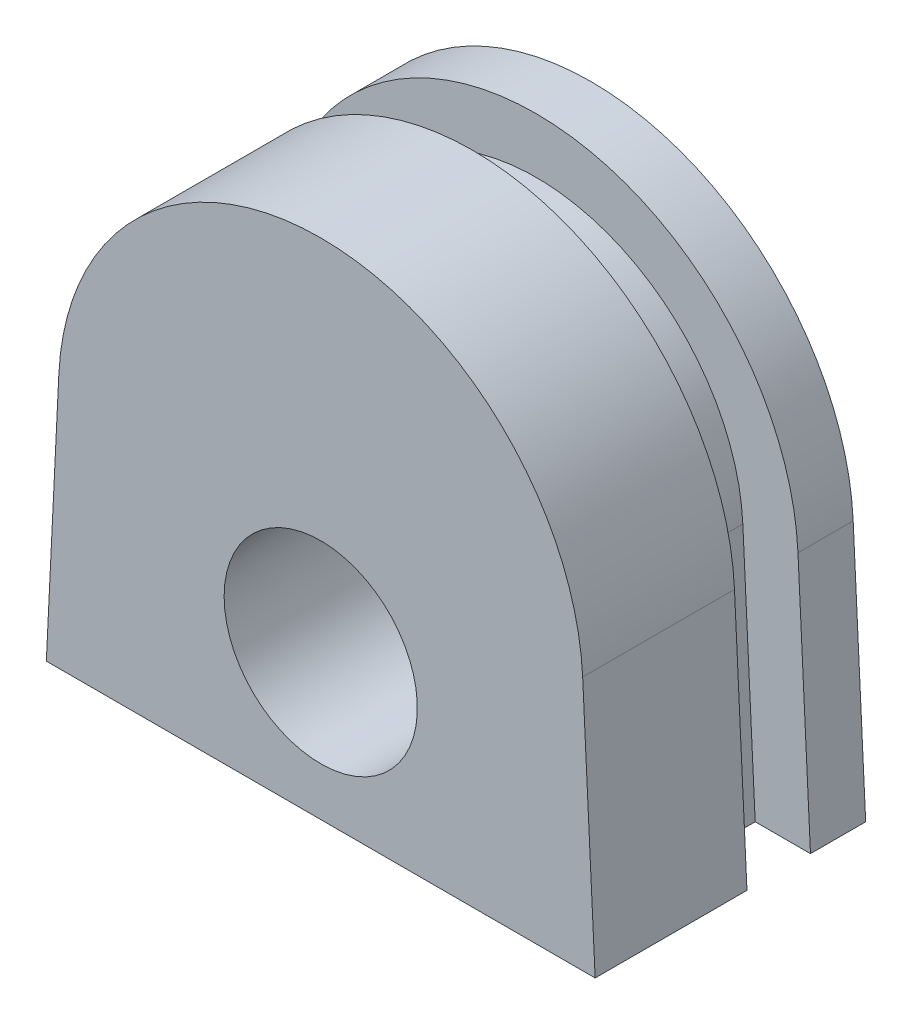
ISO-10303-21;
HEADER;
FILE_DESCRIPTION(('STEP AP214'),'2;1');
FILE_NAME('part.step','',(''),(''),'','','');
FILE_SCHEMA(('AUTOMOTIVE_DESIGN { 1 0 10303 214 1 1 1 1 }'));
ENDSEC;
DATA;
#1=APPLICATION_CONTEXT('core data for automotive mechanical design processes');
#2=APPLICATION_PROTOCOL_DEFINITION('international standard','automotive_design',2000,#1);
#3=PRODUCT_CONTEXT('',#1,'mechanical');
#4=PRODUCT('Part','Part','',(#3));
#5=PRODUCT_RELATED_PRODUCT_CATEGORY('part','',(#4));
#6=PRODUCT_DEFINITION_FORMATION('','',#4);
#7=PRODUCT_DEFINITION_CONTEXT('part definition',#1,'design');
#8=PRODUCT_DEFINITION('design','',#6,#7);
#9=PRODUCT_DEFINITION_SHAPE('','',#8);
#10=(LENGTH_UNIT() NAMED_UNIT(*) SI_UNIT(.MILLI.,.METRE.));
#11=(NAMED_UNIT(*) PLANE_ANGLE_UNIT() SI_UNIT($,.RADIAN.));
#12=(NAMED_UNIT(*) SI_UNIT($,.STERADIAN.) SOLID_ANGLE_UNIT());
#13=UNCERTAINTY_MEASURE_WITH_UNIT(LENGTH_MEASURE(1.E-05),#10,'distance_accuracy_value','');
#14=(GEOMETRIC_REPRESENTATION_CONTEXT(3) GLOBAL_UNCERTAINTY_ASSIGNED_CONTEXT((#13)) GLOBAL_UNIT_ASSIGNED_CONTEXT((#10,
#11,#12)) REPRESENTATION_CONTEXT('',''));
#15=CARTESIAN_POINT('',(0.,0.,0.));
#16=DIRECTION('',(0.,0.,1.));
#17=DIRECTION('',(1.,0.,0.));
#18=AXIS2_PLACEMENT_3D('',#15,#16,#17);
#19=CARTESIAN_POINT('',(-14.25,5.57311545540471,-2.3));
#20=DIRECTION('',(0.,0.,1.));
#21=DIRECTION('',(1.,0.,0.));
#22=AXIS2_PLACEMENT_3D('',#19,#20,#21);
#23=CYLINDRICAL_SURFACE('',#22,7.49999999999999);
#24=CARTESIAN_POINT('',(-14.25,5.57311545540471,0.));
#25=DIRECTION('',(0.,0.,1.));
#26=DIRECTION('',(1.,0.,0.));
#27=AXIS2_PLACEMENT_3D('',#24,#25,#26);
#28=CIRCLE('',#27,7.49999999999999);
#29=CARTESIAN_POINT('',(-6.7590229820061,5.94089706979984,0.));
#30=VERTEX_POINT('',#29);
#31=CARTESIAN_POINT('',(-21.7409770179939,5.94089706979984,0.));
#32=VERTEX_POINT('',#31);
#33=EDGE_CURVE('E212',#30,#32,#28,.T.);
#34=ORIENTED_EDGE('',*,*,#33,.F.);
#35=DIRECTION('',(0.,0.,1.));
#36=VECTOR('',#35,1.);
#37=CARTESIAN_POINT('',(-6.7590229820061,5.94089706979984,-2.3));
#38=LINE('',#37,#36);
#39=CARTESIAN_POINT('',(-6.7590229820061,5.94089706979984,-2.3));
#40=VERTEX_POINT('',#39);
#41=EDGE_CURVE('E11',#40,#30,#38,.T.);
#42=ORIENTED_EDGE('',*,*,#41,.F.);
#43=CARTESIAN_POINT('',(-14.25,5.57311545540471,-2.3));
#44=DIRECTION('',(0.,0.,1.));
#45=DIRECTION('',(1.,0.,0.));
#46=AXIS2_PLACEMENT_3D('',#43,#44,#45);
#47=CIRCLE('',#46,7.49999999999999);
#48=CARTESIAN_POINT('',(-21.7409770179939,5.94089706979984,-2.3));
#49=VERTEX_POINT('',#48);
#50=EDGE_CURVE('E189',#40,#49,#47,.T.);
#51=ORIENTED_EDGE('',*,*,#50,.T.);
#52=DIRECTION('',(0.,0.,1.));
#53=VECTOR('',#52,1.);
#54=CARTESIAN_POINT('',(-21.7409770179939,5.94089706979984,-2.3));
#55=LINE('',#54,#53);
#56=EDGE_CURVE('E182',#49,#32,#55,.T.);
#57=ORIENTED_EDGE('',*,*,#56,.T.);
#58=EDGE_LOOP('',(#34,#42,#51,#57));
#59=FACE_BOUND('',#58,.T.);
#60=ADVANCED_FACE('F29',(#59),#23,.T.);
#61=CARTESIAN_POINT('',(-6.31137076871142,-3.17688454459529,-2.3));
#62=DIRECTION('',(0.998796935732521,0.049037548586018,0.));
#63=DIRECTION('',(-0.049037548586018,0.998796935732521,0.));
#64=AXIS2_PLACEMENT_3D('',#61,#62,#63);
#65=PLANE('',#64);
#66=DIRECTION('',(-0.049037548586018,0.998796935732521,0.));
#67=VECTOR('',#66,1.);
#68=CARTESIAN_POINT('',(-6.31137076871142,-3.17688454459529,0.));
#69=LINE('',#68,#67);
#70=CARTESIAN_POINT('',(-6.31137076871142,-3.17688454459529,0.));
#71=VERTEX_POINT('',#70);
#72=EDGE_CURVE('E192',#71,#30,#69,.T.);
#73=ORIENTED_EDGE('',*,*,#72,.F.);
#74=DIRECTION('',(0.,0.,1.));
#75=VECTOR('',#74,1.);
#76=CARTESIAN_POINT('',(-6.31137076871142,-3.17688454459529,-2.3));
#77=LINE('',#76,#75);
#78=CARTESIAN_POINT('',(-6.31137076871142,-3.17688454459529,-2.3));
#79=VERTEX_POINT('',#78);
#80=EDGE_CURVE('E37',#79,#71,#77,.T.);
#81=ORIENTED_EDGE('',*,*,#80,.F.);
#82=DIRECTION('',(-0.049037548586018,0.998796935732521,0.));
#83=VECTOR('',#82,1.);
#84=CARTESIAN_POINT('',(-6.31137076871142,-3.17688454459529,-2.3));
#85=LINE('',#84,#83);
#86=EDGE_CURVE('E188',#79,#40,#85,.T.);
#87=ORIENTED_EDGE('',*,*,#86,.T.);
#88=ORIENTED_EDGE('',*,*,#41,.T.);
#89=EDGE_LOOP('',(#73,#81,#87,#88));
#90=FACE_BOUND('',#89,.T.);
#91=ADVANCED_FACE('F276',(#90),#65,.T.);
#92=CARTESIAN_POINT('',(-6.31137076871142,-3.17688454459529,-2.3));
#93=DIRECTION('',(0.,-1.,0.));
#94=DIRECTION('',(1.,0.,0.));
#95=AXIS2_PLACEMENT_3D('',#92,#93,#94);
#96=PLANE('',#95);
#97=ORIENTED_EDGE('',*,*,#80,.T.);
#98=DIRECTION('',(1.,0.,0.));
#99=VECTOR('',#98,1.);
#100=CARTESIAN_POINT('',(-4.30896174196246,-3.17688454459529,0.));
#101=LINE('',#100,#99);
#102=CARTESIAN_POINT('',(-4.30896174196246,-3.17688454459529,0.));
#103=VERTEX_POINT('',#102);
#104=EDGE_CURVE('E218',#71,#103,#101,.T.);
#105=ORIENTED_EDGE('',*,*,#104,.T.);
#106=DIRECTION('',(0.,0.,-1.));
#107=VECTOR('',#106,1.);
#108=CARTESIAN_POINT('',(-4.30896174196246,-3.17688454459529,5.5));
#109=LINE('',#108,#107);
#110=CARTESIAN_POINT('',(-4.30896174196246,-3.17688454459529,5.5));
#111=VERTEX_POINT('',#110);
#112=EDGE_CURVE('E215',#111,#103,#109,.T.);
#113=ORIENTED_EDGE('',*,*,#112,.F.);
#114=DIRECTION('',(1.,0.,0.));
#115=VECTOR('',#114,1.);
#116=CARTESIAN_POINT('',(-4.30896174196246,-3.17688454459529,5.5));
#117=LINE('',#116,#115);
#118=CARTESIAN_POINT('',(-24.1910382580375,-3.17688454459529,5.5));
#119=VERTEX_POINT('',#118);
#120=EDGE_CURVE('E232',#119,#111,#117,.T.);
#121=ORIENTED_EDGE('',*,*,#120,.F.);
#122=DIRECTION('',(0.,0.,-1.));
#123=VECTOR('',#122,1.);
#124=CARTESIAN_POINT('',(-24.1910382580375,-3.17688454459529,5.5));
#125=LINE('',#124,#123);
#126=CARTESIAN_POINT('',(-24.1910382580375,-3.17688454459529,0.));
#127=VERTEX_POINT('',#126);
#128=EDGE_CURVE('E213',#119,#127,#125,.T.);
#129=ORIENTED_EDGE('',*,*,#128,.T.);
#130=CARTESIAN_POINT('',(-22.1886292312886,-3.17688454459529,0.));
#131=VERTEX_POINT('',#130);
#132=EDGE_CURVE('E178',#127,#131,#101,.T.);
#133=ORIENTED_EDGE('',*,*,#132,.T.);
#134=DIRECTION('',(0.,0.,1.));
#135=VECTOR('',#134,1.);
#136=CARTESIAN_POINT('',(-22.1886292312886,-3.17688454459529,-2.3));
#137=LINE('',#136,#135);
#138=CARTESIAN_POINT('',(-22.1886292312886,-3.17688454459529,-2.3));
#139=VERTEX_POINT('',#138);
#140=EDGE_CURVE('E175',#139,#131,#137,.T.);
#141=ORIENTED_EDGE('',*,*,#140,.F.);
#142=DIRECTION('',(-1.,0.,0.));
#143=VECTOR('',#142,1.);
#144=CARTESIAN_POINT('',(-4.30896174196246,-3.17688454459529,-2.3));
#145=LINE('',#144,#143);
#146=CARTESIAN_POINT('',(-24.1910382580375,-3.17688454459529,-2.3));
#147=VERTEX_POINT('',#146);
#148=EDGE_CURVE('E45',#139,#147,#145,.T.);
#149=ORIENTED_EDGE('',*,*,#148,.T.);
#150=DIRECTION('',(0.,0.,1.));
#151=VECTOR('',#150,1.);
#152=CARTESIAN_POINT('',(-24.1910382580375,-3.17688454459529,-4.3));
#153=LINE('',#152,#151);
#154=CARTESIAN_POINT('',(-24.1910382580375,-3.17688454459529,-4.3));
#155=VERTEX_POINT('',#154);
#156=EDGE_CURVE('E141',#155,#147,#153,.T.);
#157=ORIENTED_EDGE('',*,*,#156,.F.);
#158=DIRECTION('',(-1.,0.,0.));
#159=VECTOR('',#158,1.);
#160=CARTESIAN_POINT('',(-4.30896174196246,-3.17688454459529,-4.3));
#161=LINE('',#160,#159);
#162=CARTESIAN_POINT('',(-4.30896174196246,-3.17688454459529,-4.3));
#163=VERTEX_POINT('',#162);
#164=EDGE_CURVE('E165',#163,#155,#161,.T.);
#165=ORIENTED_EDGE('',*,*,#164,.F.);
#166=DIRECTION('',(0.,0.,1.));
#167=VECTOR('',#166,1.);
#168=CARTESIAN_POINT('',(-4.30896174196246,-3.17688454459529,-4.3));
#169=LINE('',#168,#167);
#170=CARTESIAN_POINT('',(-4.30896174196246,-3.17688454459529,-2.3));
#171=VERTEX_POINT('',#170);
#172=EDGE_CURVE('E161',#163,#171,#169,.T.);
#173=ORIENTED_EDGE('',*,*,#172,.T.);
#174=EDGE_CURVE('E158',#171,#79,#145,.T.);
#175=ORIENTED_EDGE('',*,*,#174,.T.);
#176=EDGE_LOOP('',(#97,#105,#113,#121,#129,#133,#141,#149,#157,#165,#173,#175));
#177=FACE_BOUND('',#176,.T.);
#178=ADVANCED_FACE('F173',(#177),#96,.T.);
#179=CARTESIAN_POINT('',(-21.7409770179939,5.94089706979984,-2.3));
#180=DIRECTION('',(-0.998796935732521,0.049037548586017,0.));
#181=DIRECTION('',(-0.049037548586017,-0.998796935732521,0.));
#182=AXIS2_PLACEMENT_3D('',#179,#180,#181);
#183=PLANE('',#182);
#184=DIRECTION('',(-0.049037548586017,-0.998796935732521,0.));
#185=VECTOR('',#184,1.);
#186=CARTESIAN_POINT('',(-21.7409770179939,5.94089706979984,0.));
#187=LINE('',#186,#185);
#188=EDGE_CURVE('E196',#32,#131,#187,.T.);
#189=ORIENTED_EDGE('',*,*,#188,.F.);
#190=ORIENTED_EDGE('',*,*,#56,.F.);
#191=DIRECTION('',(-0.049037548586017,-0.998796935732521,0.));
#192=VECTOR('',#191,1.);
#193=CARTESIAN_POINT('',(-21.7409770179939,5.94089706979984,-2.3));
#194=LINE('',#193,#192);
#195=EDGE_CURVE('E185',#49,#139,#194,.T.);
#196=ORIENTED_EDGE('',*,*,#195,.T.);
#197=ORIENTED_EDGE('',*,*,#140,.T.);
#198=EDGE_LOOP('',(#189,#190,#196,#197));
#199=FACE_BOUND('',#198,.T.);
#200=ADVANCED_FACE('F186',(#199),#183,.T.);
#201=CARTESIAN_POINT('',(-14.25,5.57311545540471,0.));
#202=DIRECTION('',(0.,0.,1.));
#203=DIRECTION('',(1.,0.,0.));
#204=AXIS2_PLACEMENT_3D('',#201,#202,#203);
#205=PLANE('',#204);
#206=ORIENTED_EDGE('',*,*,#33,.T.);
#207=ORIENTED_EDGE('',*,*,#188,.T.);
#208=ORIENTED_EDGE('',*,*,#132,.F.);
#209=DIRECTION('',(-0.049037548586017,-0.998796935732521,0.));
#210=VECTOR('',#209,1.);
#211=CARTESIAN_POINT('',(-23.7385708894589,6.03897216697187,0.));
#212=LINE('',#211,#210);
#213=CARTESIAN_POINT('',(-23.7385708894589,6.03897216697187,0.));
#214=VERTEX_POINT('',#213);
#215=EDGE_CURVE('E135',#214,#127,#212,.T.);
#216=ORIENTED_EDGE('',*,*,#215,.F.);
#217=CARTESIAN_POINT('',(-14.25,5.57311545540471,0.));
#218=DIRECTION('',(0.,0.,1.));
#219=DIRECTION('',(1.,0.,0.));
#220=AXIS2_PLACEMENT_3D('',#217,#218,#219);
#221=CIRCLE('',#220,9.49999999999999);
#222=CARTESIAN_POINT('',(-4.76142911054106,6.03897216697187,0.));
#223=VERTEX_POINT('',#222);
#224=EDGE_CURVE('E227',#223,#214,#221,.T.);
#225=ORIENTED_EDGE('',*,*,#224,.F.);
#226=DIRECTION('',(-0.0490375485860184,0.998796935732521,0.));
#227=VECTOR('',#226,1.);
#228=CARTESIAN_POINT('',(-4.30896174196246,-3.17688454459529,0.));
#229=LINE('',#228,#227);
#230=EDGE_CURVE('E224',#103,#223,#229,.T.);
#231=ORIENTED_EDGE('',*,*,#230,.F.);
#232=ORIENTED_EDGE('',*,*,#104,.F.);
#233=ORIENTED_EDGE('',*,*,#72,.T.);
#234=EDGE_LOOP('',(#206,#207,#208,#216,#225,#231,#232,#233));
#235=FACE_BOUND('',#234,.T.);
#236=ADVANCED_FACE('F252',(#235),#205,.F.);
#237=CARTESIAN_POINT('',(-23.7385708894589,6.03897216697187,5.5));
#238=DIRECTION('',(0.998796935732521,-0.049037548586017,0.));
#239=DIRECTION('',(0.049037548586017,0.998796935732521,0.));
#240=AXIS2_PLACEMENT_3D('',#237,#238,#239);
#241=PLANE('',#240);
#242=ORIENTED_EDGE('',*,*,#215,.T.);
#243=ORIENTED_EDGE('',*,*,#128,.F.);
#244=DIRECTION('',(-0.049037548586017,-0.998796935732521,0.));
#245=VECTOR('',#244,1.);
#246=CARTESIAN_POINT('',(-23.7385708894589,6.03897216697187,5.5));
#247=LINE('',#246,#245);
#248=CARTESIAN_POINT('',(-23.7385708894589,6.03897216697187,5.5));
#249=VERTEX_POINT('',#248);
#250=EDGE_CURVE('E229',#249,#119,#247,.T.);
#251=ORIENTED_EDGE('',*,*,#250,.F.);
#252=DIRECTION('',(0.,0.,-1.));
#253=VECTOR('',#252,1.);
#254=CARTESIAN_POINT('',(-23.7385708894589,6.03897216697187,5.5));
#255=LINE('',#254,#253);
#256=EDGE_CURVE('E238',#249,#214,#255,.T.);
#257=ORIENTED_EDGE('',*,*,#256,.T.);
#258=EDGE_LOOP('',(#242,#243,#251,#257));
#259=FACE_BOUND('',#258,.T.);
#260=ADVANCED_FACE('F261',(#259),#241,.F.);
#261=CARTESIAN_POINT('',(-4.30896174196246,-3.17688454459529,5.5));
#262=DIRECTION('',(-0.998796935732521,-0.0490375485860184,0.));
#263=DIRECTION('',(0.0490375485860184,-0.998796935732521,0.));
#264=AXIS2_PLACEMENT_3D('',#261,#262,#263);
#265=PLANE('',#264);
#266=ORIENTED_EDGE('',*,*,#230,.T.);
#267=DIRECTION('',(0.,0.,-1.));
#268=VECTOR('',#267,1.);
#269=CARTESIAN_POINT('',(-4.76142911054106,6.03897216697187,5.5));
#270=LINE('',#269,#268);
#271=CARTESIAN_POINT('',(-4.76142911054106,6.03897216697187,5.5));
#272=VERTEX_POINT('',#271);
#273=EDGE_CURVE('E241',#272,#223,#270,.T.);
#274=ORIENTED_EDGE('',*,*,#273,.F.);
#275=DIRECTION('',(-0.0490375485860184,0.998796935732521,0.));
#276=VECTOR('',#275,1.);
#277=CARTESIAN_POINT('',(-4.30896174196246,-3.17688454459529,5.5));
#278=LINE('',#277,#276);
#279=EDGE_CURVE('E234',#111,#272,#278,.T.);
#280=ORIENTED_EDGE('',*,*,#279,.F.);
#281=ORIENTED_EDGE('',*,*,#112,.T.);
#282=EDGE_LOOP('',(#266,#274,#280,#281));
#283=FACE_BOUND('',#282,.T.);
#284=ADVANCED_FACE('F249',(#283),#265,.F.);
#285=CARTESIAN_POINT('',(-14.25,5.57311545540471,5.5));
#286=DIRECTION('',(0.,0.,-1.));
#287=DIRECTION('',(-1.,0.,0.));
#288=AXIS2_PLACEMENT_3D('',#285,#286,#287);
#289=CYLINDRICAL_SURFACE('',#288,9.49999999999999);
#290=ORIENTED_EDGE('',*,*,#224,.T.);
#291=ORIENTED_EDGE('',*,*,#256,.F.);
#292=CARTESIAN_POINT('',(-14.25,5.57311545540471,5.5));
#293=DIRECTION('',(0.,0.,1.));
#294=DIRECTION('',(1.,0.,0.));
#295=AXIS2_PLACEMENT_3D('',#292,#293,#294);
#296=CIRCLE('',#295,9.49999999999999);
#297=EDGE_CURVE('E236',#272,#249,#296,.T.);
#298=ORIENTED_EDGE('',*,*,#297,.F.);
#299=ORIENTED_EDGE('',*,*,#273,.T.);
#300=EDGE_LOOP('',(#290,#291,#298,#299));
#301=FACE_BOUND('',#300,.T.);
#302=ADVANCED_FACE('F257',(#301),#289,.T.);
#303=CARTESIAN_POINT('',(-14.25,5.57311545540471,5.5));
#304=DIRECTION('',(0.,0.,1.));
#305=DIRECTION('',(1.,0.,0.));
#306=AXIS2_PLACEMENT_3D('',#303,#304,#305);
#307=PLANE('',#306);
#308=CARTESIAN_POINT('',(-14.25,2.07311545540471,5.5));
#309=DIRECTION('',(0.,0.,-1.));
#310=DIRECTION('',(-1.,0.,0.));
#311=AXIS2_PLACEMENT_3D('',#308,#309,#310);
#312=CIRCLE('',#311,3.5);
#313=CARTESIAN_POINT('',(-17.75,2.07311545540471,5.5));
#314=VERTEX_POINT('',#313);
#315=EDGE_CURVE('E142',#314,#314,#312,.T.);
#316=ORIENTED_EDGE('',*,*,#315,.T.);
#317=EDGE_LOOP('',(#316));
#318=FACE_BOUND('',#317,.T.);
#319=ORIENTED_EDGE('',*,*,#250,.T.);
#320=ORIENTED_EDGE('',*,*,#120,.T.);
#321=ORIENTED_EDGE('',*,*,#279,.T.);
#322=ORIENTED_EDGE('',*,*,#297,.T.);
#323=EDGE_LOOP('',(#319,#320,#321,#322));
#324=FACE_BOUND('',#323,.T.);
#325=ADVANCED_FACE('F264',(#318,#324),#307,.T.);
#326=CARTESIAN_POINT('',(-24.1910382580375,-3.17688454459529,-4.3));
#327=DIRECTION('',(0.998796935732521,-0.0490375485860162,0.));
#328=DIRECTION('',(0.0490375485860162,0.998796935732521,0.));
#329=AXIS2_PLACEMENT_3D('',#326,#327,#328);
#330=PLANE('',#329);
#331=DIRECTION('',(0.0490375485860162,0.998796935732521,0.));
#332=VECTOR('',#331,1.);
#333=CARTESIAN_POINT('',(-24.1910382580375,-3.17688454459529,-2.3));
#334=LINE('',#333,#332);
#335=CARTESIAN_POINT('',(-23.7385708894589,6.03897216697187,-2.3));
#336=VERTEX_POINT('',#335);
#337=EDGE_CURVE('E121',#147,#336,#334,.T.);
#338=ORIENTED_EDGE('',*,*,#337,.T.);
#339=DIRECTION('',(0.,0.,1.));
#340=VECTOR('',#339,1.);
#341=CARTESIAN_POINT('',(-23.7385708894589,6.03897216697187,-4.3));
#342=LINE('',#341,#340);
#343=CARTESIAN_POINT('',(-23.7385708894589,6.03897216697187,-4.3));
#344=VERTEX_POINT('',#343);
#345=EDGE_CURVE('E129',#344,#336,#342,.T.);
#346=ORIENTED_EDGE('',*,*,#345,.F.);
#347=DIRECTION('',(0.0490375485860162,0.998796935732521,0.));
#348=VECTOR('',#347,1.);
#349=CARTESIAN_POINT('',(-24.1910382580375,-3.17688454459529,-4.3));
#350=LINE('',#349,#348);
#351=EDGE_CURVE('E152',#155,#344,#350,.T.);
#352=ORIENTED_EDGE('',*,*,#351,.F.);
#353=ORIENTED_EDGE('',*,*,#156,.T.);
#354=EDGE_LOOP('',(#338,#346,#352,#353));
#355=FACE_BOUND('',#354,.T.);
#356=ADVANCED_FACE('F139',(#355),#330,.F.);
#357=CARTESIAN_POINT('',(-14.25,5.57311545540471,-4.3));
#358=DIRECTION('',(0.,0.,1.));
#359=DIRECTION('',(1.,0.,0.));
#360=AXIS2_PLACEMENT_3D('',#357,#358,#359);
#361=CYLINDRICAL_SURFACE('',#360,9.49999999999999);
#362=CARTESIAN_POINT('',(-14.25,5.57311545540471,-2.3));
#363=DIRECTION('',(0.,0.,-1.));
#364=DIRECTION('',(-1.,0.,0.));
#365=AXIS2_PLACEMENT_3D('',#362,#363,#364);
#366=CIRCLE('',#365,9.49999999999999);
#367=CARTESIAN_POINT('',(-4.76142911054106,6.03897216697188,-2.3));
#368=VERTEX_POINT('',#367);
#369=EDGE_CURVE('E117',#336,#368,#366,.T.);
#370=ORIENTED_EDGE('',*,*,#369,.T.);
#371=DIRECTION('',(0.,0.,1.));
#372=VECTOR('',#371,1.);
#373=CARTESIAN_POINT('',(-4.76142911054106,6.03897216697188,-4.3));
#374=LINE('',#373,#372);
#375=CARTESIAN_POINT('',(-4.76142911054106,6.03897216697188,-4.3));
#376=VERTEX_POINT('',#375);
#377=EDGE_CURVE('E136',#376,#368,#374,.T.);
#378=ORIENTED_EDGE('',*,*,#377,.F.);
#379=CARTESIAN_POINT('',(-14.25,5.57311545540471,-4.3));
#380=DIRECTION('',(0.,0.,-1.));
#381=DIRECTION('',(-1.,0.,0.));
#382=AXIS2_PLACEMENT_3D('',#379,#380,#381);
#383=CIRCLE('',#382,9.49999999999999);
#384=EDGE_CURVE('E131',#344,#376,#383,.T.);
#385=ORIENTED_EDGE('',*,*,#384,.F.);
#386=ORIENTED_EDGE('',*,*,#345,.T.);
#387=EDGE_LOOP('',(#370,#378,#385,#386));
#388=FACE_BOUND('',#387,.T.);
#389=ADVANCED_FACE('F130',(#388),#361,.T.);
#390=CARTESIAN_POINT('',(-4.76142911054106,6.03897216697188,-4.3));
#391=DIRECTION('',(-0.998796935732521,-0.0490375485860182,0.));
#392=DIRECTION('',(0.0490375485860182,-0.998796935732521,0.));
#393=AXIS2_PLACEMENT_3D('',#390,#391,#392);
#394=PLANE('',#393);
#395=DIRECTION('',(0.0490375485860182,-0.998796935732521,0.));
#396=VECTOR('',#395,1.);
#397=CARTESIAN_POINT('',(-4.76142911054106,6.03897216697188,-2.3));
#398=LINE('',#397,#396);
#399=EDGE_CURVE('E123',#368,#171,#398,.T.);
#400=ORIENTED_EDGE('',*,*,#399,.T.);
#401=ORIENTED_EDGE('',*,*,#172,.F.);
#402=DIRECTION('',(0.0490375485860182,-0.998796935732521,0.));
#403=VECTOR('',#402,1.);
#404=CARTESIAN_POINT('',(-4.76142911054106,6.03897216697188,-4.3));
#405=LINE('',#404,#403);
#406=EDGE_CURVE('E167',#376,#163,#405,.T.);
#407=ORIENTED_EDGE('',*,*,#406,.F.);
#408=ORIENTED_EDGE('',*,*,#377,.T.);
#409=EDGE_LOOP('',(#400,#401,#407,#408));
#410=FACE_BOUND('',#409,.T.);
#411=ADVANCED_FACE('F285',(#410),#394,.F.);
#412=CARTESIAN_POINT('',(-14.25,5.57311545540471,-4.3));
#413=DIRECTION('',(0.,0.,-1.));
#414=DIRECTION('',(-1.,0.,0.));
#415=AXIS2_PLACEMENT_3D('',#412,#413,#414);
#416=PLANE('',#415);
#417=CARTESIAN_POINT('',(-14.25,2.07311545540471,-4.3));
#418=DIRECTION('',(0.,0.,-1.));
#419=DIRECTION('',(-1.,0.,0.));
#420=AXIS2_PLACEMENT_3D('',#417,#418,#419);
#421=CIRCLE('',#420,3.5);
#422=CARTESIAN_POINT('',(-17.75,2.07311545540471,-4.3));
#423=VERTEX_POINT('',#422);
#424=EDGE_CURVE('E145',#423,#423,#421,.T.);
#425=ORIENTED_EDGE('',*,*,#424,.F.);
#426=EDGE_LOOP('',(#425));
#427=FACE_BOUND('',#426,.T.);
#428=ORIENTED_EDGE('',*,*,#351,.T.);
#429=ORIENTED_EDGE('',*,*,#384,.T.);
#430=ORIENTED_EDGE('',*,*,#406,.T.);
#431=ORIENTED_EDGE('',*,*,#164,.T.);
#432=EDGE_LOOP('',(#428,#429,#430,#431));
#433=FACE_BOUND('',#432,.T.);
#434=ADVANCED_FACE('F169',(#427,#433),#416,.T.);
#435=CARTESIAN_POINT('',(-14.25,5.57311545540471,-2.3));
#436=DIRECTION('',(0.,0.,-1.));
#437=DIRECTION('',(-1.,0.,0.));
#438=AXIS2_PLACEMENT_3D('',#435,#436,#437);
#439=PLANE('',#438);
#440=ORIENTED_EDGE('',*,*,#86,.F.);
#441=ORIENTED_EDGE('',*,*,#174,.F.);
#442=ORIENTED_EDGE('',*,*,#399,.F.);
#443=ORIENTED_EDGE('',*,*,#369,.F.);
#444=ORIENTED_EDGE('',*,*,#337,.F.);
#445=ORIENTED_EDGE('',*,*,#148,.F.);
#446=ORIENTED_EDGE('',*,*,#195,.F.);
#447=ORIENTED_EDGE('',*,*,#50,.F.);
#448=EDGE_LOOP('',(#440,#441,#442,#443,#444,#445,#446,#447));
#449=FACE_BOUND('',#448,.T.);
#450=ADVANCED_FACE('F119',(#449),#439,.F.);
#451=CARTESIAN_POINT('',(-14.25,2.07311545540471,5.5));
#452=DIRECTION('',(0.,0.,-1.));
#453=DIRECTION('',(-1.,0.,0.));
#454=AXIS2_PLACEMENT_3D('',#451,#452,#453);
#455=CYLINDRICAL_SURFACE('',#454,3.5);
#456=ORIENTED_EDGE('',*,*,#315,.F.);
#457=EDGE_LOOP('',(#456));
#458=FACE_BOUND('',#457,.T.);
#459=ORIENTED_EDGE('',*,*,#424,.T.);
#460=EDGE_LOOP('',(#459));
#461=FACE_BOUND('',#460,.T.);
#462=ADVANCED_FACE('F352',(#458,#461),#455,.F.);
#463=CLOSED_SHELL('',(#60,#91,#178,#200,#236,#260,#284,#302,#325,#356,#389,#411,#434,#450,#462));
#464=MANIFOLD_SOLID_BREP('B2',#463);
#465=ADVANCED_BREP_SHAPE_REPRESENTATION('',(#18,#464),#14);
#466=SHAPE_DEFINITION_REPRESENTATION(#9,#465);
ENDSEC;
END-ISO-10303-21;
